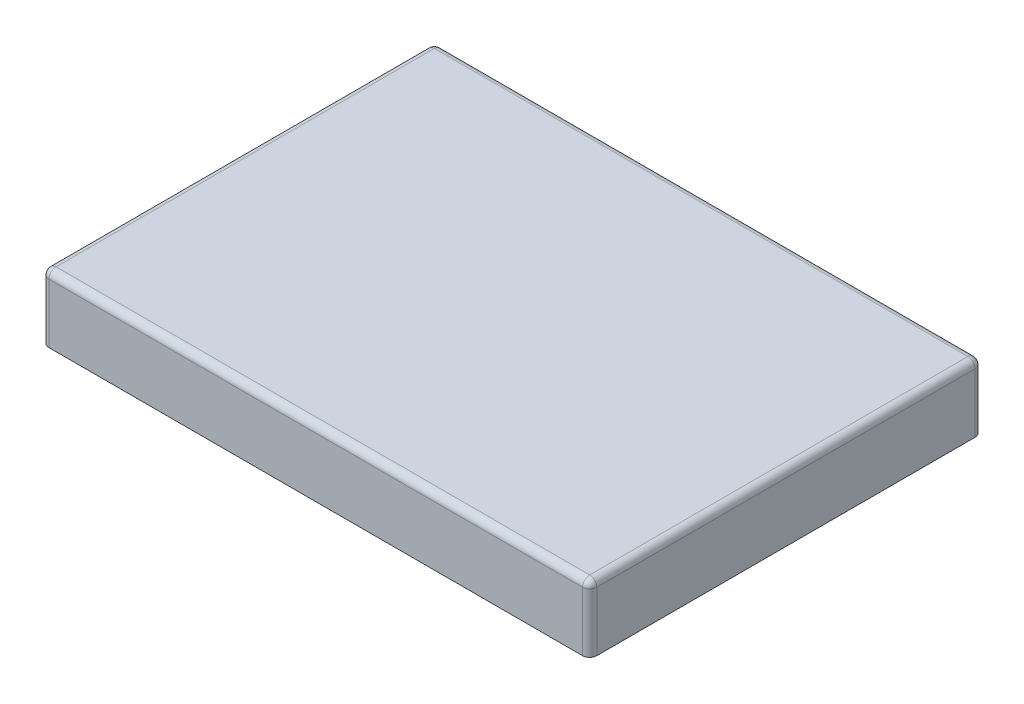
ISO-10303-21;
HEADER;
FILE_DESCRIPTION(('STEP AP214'),'2;1');
FILE_NAME('part.step','',(''),(''),'','','');
FILE_SCHEMA(('AUTOMOTIVE_DESIGN { 1 0 10303 214 1 1 1 1 }'));
ENDSEC;
DATA;
#1=APPLICATION_CONTEXT('core data for automotive mechanical design processes');
#2=APPLICATION_PROTOCOL_DEFINITION('international standard','automotive_design',2000,#1);
#3=PRODUCT_CONTEXT('',#1,'mechanical');
#4=PRODUCT('Part','Part','',(#3));
#5=PRODUCT_RELATED_PRODUCT_CATEGORY('part','',(#4));
#6=PRODUCT_DEFINITION_FORMATION('','',#4);
#7=PRODUCT_DEFINITION_CONTEXT('part definition',#1,'design');
#8=PRODUCT_DEFINITION('design','',#6,#7);
#9=PRODUCT_DEFINITION_SHAPE('','',#8);
#10=(LENGTH_UNIT() NAMED_UNIT(*) SI_UNIT(.MILLI.,.METRE.));
#11=(NAMED_UNIT(*) PLANE_ANGLE_UNIT() SI_UNIT($,.RADIAN.));
#12=(NAMED_UNIT(*) SI_UNIT($,.STERADIAN.) SOLID_ANGLE_UNIT());
#13=UNCERTAINTY_MEASURE_WITH_UNIT(LENGTH_MEASURE(1.E-05),#10,'distance_accuracy_value','');
#14=(GEOMETRIC_REPRESENTATION_CONTEXT(3) GLOBAL_UNCERTAINTY_ASSIGNED_CONTEXT((#13)) GLOBAL_UNIT_ASSIGNED_CONTEXT((#10,
#11,#12)) REPRESENTATION_CONTEXT('',''));
#15=CARTESIAN_POINT('',(0.,0.,0.));
#16=DIRECTION('',(0.,0.,1.));
#17=DIRECTION('',(1.,0.,0.));
#18=AXIS2_PLACEMENT_3D('',#15,#16,#17);
#19=CARTESIAN_POINT('',(0.,102.,0.));
#20=DIRECTION('',(0.,1.,0.));
#21=DIRECTION('',(0.,0.,1.));
#22=AXIS2_PLACEMENT_3D('',#19,#20,#21);
#23=PLANE('',#22);
#24=CARTESIAN_POINT('',(225.,102.,159.5));
#25=DIRECTION('',(0.,1.,0.));
#26=DIRECTION('',(0.,0.,1.));
#27=AXIS2_PLACEMENT_3D('',#24,#25,#26);
#28=CIRCLE('',#27,6.);
#29=CARTESIAN_POINT('',(231.,102.,159.5));
#30=VERTEX_POINT('',#29);
#31=CARTESIAN_POINT('',(225.,102.,165.5));
#32=VERTEX_POINT('',#31);
#33=EDGE_CURVE('E38',#30,#32,#28,.F.);
#34=ORIENTED_EDGE('',*,*,#33,.T.);
#35=DIRECTION('',(1.,0.,0.));
#36=VECTOR('',#35,1.);
#37=CARTESIAN_POINT('',(-231.,102.,165.5));
#38=LINE('',#37,#36);
#39=CARTESIAN_POINT('',(-225.,102.,165.5));
#40=VERTEX_POINT('',#39);
#41=EDGE_CURVE('E247',#40,#32,#38,.T.);
#42=ORIENTED_EDGE('',*,*,#41,.F.);
#43=CARTESIAN_POINT('',(-225.,102.,159.5));
#44=DIRECTION('',(0.,1.,0.));
#45=DIRECTION('',(0.,0.,1.));
#46=AXIS2_PLACEMENT_3D('',#43,#44,#45);
#47=CIRCLE('',#46,6.);
#48=CARTESIAN_POINT('',(-231.,102.,159.5));
#49=VERTEX_POINT('',#48);
#50=EDGE_CURVE('E250',#40,#49,#47,.F.);
#51=ORIENTED_EDGE('',*,*,#50,.T.);
#52=DIRECTION('',(0.,0.,1.));
#53=VECTOR('',#52,1.);
#54=CARTESIAN_POINT('',(-231.,102.,165.5));
#55=LINE('',#54,#53);
#56=CARTESIAN_POINT('',(-231.,102.,-159.5));
#57=VERTEX_POINT('',#56);
#58=EDGE_CURVE('E245',#57,#49,#55,.T.);
#59=ORIENTED_EDGE('',*,*,#58,.F.);
#60=CARTESIAN_POINT('',(-225.,102.,-159.5));
#61=DIRECTION('',(0.,1.,0.));
#62=DIRECTION('',(0.,0.,1.));
#63=AXIS2_PLACEMENT_3D('',#60,#61,#62);
#64=CIRCLE('',#63,6.);
#65=CARTESIAN_POINT('',(-225.,102.,-165.5));
#66=VERTEX_POINT('',#65);
#67=EDGE_CURVE('E239',#57,#66,#64,.F.);
#68=ORIENTED_EDGE('',*,*,#67,.T.);
#69=DIRECTION('',(-1.,0.,0.));
#70=VECTOR('',#69,1.);
#71=CARTESIAN_POINT('',(-231.,102.,-165.5));
#72=LINE('',#71,#70);
#73=CARTESIAN_POINT('',(225.,102.,-165.5));
#74=VERTEX_POINT('',#73);
#75=EDGE_CURVE('E203',#74,#66,#72,.T.);
#76=ORIENTED_EDGE('',*,*,#75,.F.);
#77=CARTESIAN_POINT('',(225.,102.,-159.5));
#78=DIRECTION('',(0.,1.,0.));
#79=DIRECTION('',(0.,0.,1.));
#80=AXIS2_PLACEMENT_3D('',#77,#78,#79);
#81=CIRCLE('',#80,6.);
#82=CARTESIAN_POINT('',(231.,102.,-159.5));
#83=VERTEX_POINT('',#82);
#84=EDGE_CURVE('E242',#74,#83,#81,.F.);
#85=ORIENTED_EDGE('',*,*,#84,.T.);
#86=DIRECTION('',(0.,0.,-1.));
#87=VECTOR('',#86,1.);
#88=CARTESIAN_POINT('',(231.,102.,165.5));
#89=LINE('',#88,#87);
#90=EDGE_CURVE('E244',#30,#83,#89,.T.);
#91=ORIENTED_EDGE('',*,*,#90,.F.);
#92=EDGE_LOOP('',(#34,#42,#51,#59,#68,#76,#85,#91));
#93=FACE_BOUND('',#92,.T.);
#94=DIRECTION('',(0.,0.,-1.));
#95=VECTOR('',#94,1.);
#96=CARTESIAN_POINT('',(221.,102.,-155.5));
#97=LINE('',#96,#95);
#98=CARTESIAN_POINT('',(221.,102.,155.5));
#99=VERTEX_POINT('',#98);
#100=CARTESIAN_POINT('',(221.,102.,-155.5));
#101=VERTEX_POINT('',#100);
#102=EDGE_CURVE('E237',#99,#101,#97,.T.);
#103=ORIENTED_EDGE('',*,*,#102,.T.);
#104=DIRECTION('',(-1.,0.,0.));
#105=VECTOR('',#104,1.);
#106=CARTESIAN_POINT('',(221.,102.,-155.5));
#107=LINE('',#106,#105);
#108=CARTESIAN_POINT('',(-221.,102.,-155.5));
#109=VERTEX_POINT('',#108);
#110=EDGE_CURVE('E155',#101,#109,#107,.T.);
#111=ORIENTED_EDGE('',*,*,#110,.T.);
#112=DIRECTION('',(0.,0.,1.));
#113=VECTOR('',#112,1.);
#114=CARTESIAN_POINT('',(-221.,102.,-155.5));
#115=LINE('',#114,#113);
#116=CARTESIAN_POINT('',(-221.,102.,155.5));
#117=VERTEX_POINT('',#116);
#118=EDGE_CURVE('E43',#109,#117,#115,.T.);
#119=ORIENTED_EDGE('',*,*,#118,.T.);
#120=DIRECTION('',(1.,0.,0.));
#121=VECTOR('',#120,1.);
#122=CARTESIAN_POINT('',(221.,102.,155.5));
#123=LINE('',#122,#121);
#124=EDGE_CURVE('E11',#117,#99,#123,.T.);
#125=ORIENTED_EDGE('',*,*,#124,.T.);
#126=EDGE_LOOP('',(#103,#111,#119,#125));
#127=FACE_BOUND('',#126,.T.);
#128=ADVANCED_FACE('F35',(#93,#127),#23,.F.);
#129=CARTESIAN_POINT('',(221.,147.,-155.5));
#130=DIRECTION('',(-1.,0.,0.));
#131=DIRECTION('',(0.,0.,1.));
#132=AXIS2_PLACEMENT_3D('',#129,#130,#131);
#133=PLANE('',#132);
#134=ORIENTED_EDGE('',*,*,#102,.F.);
#135=DIRECTION('',(0.,-1.,0.));
#136=VECTOR('',#135,1.);
#137=CARTESIAN_POINT('',(221.,147.,155.5));
#138=LINE('',#137,#136);
#139=CARTESIAN_POINT('',(221.,147.,155.5));
#140=VERTEX_POINT('',#139);
#141=EDGE_CURVE('E151',#140,#99,#138,.T.);
#142=ORIENTED_EDGE('',*,*,#141,.F.);
#143=DIRECTION('',(0.,0.,-1.));
#144=VECTOR('',#143,1.);
#145=CARTESIAN_POINT('',(221.,147.,-155.5));
#146=LINE('',#145,#144);
#147=CARTESIAN_POINT('',(221.,147.,-155.5));
#148=VERTEX_POINT('',#147);
#149=EDGE_CURVE('E139',#140,#148,#146,.T.);
#150=ORIENTED_EDGE('',*,*,#149,.T.);
#151=DIRECTION('',(0.,-1.,0.));
#152=VECTOR('',#151,1.);
#153=CARTESIAN_POINT('',(221.,147.,-155.5));
#154=LINE('',#153,#152);
#155=EDGE_CURVE('E150',#148,#101,#154,.T.);
#156=ORIENTED_EDGE('',*,*,#155,.T.);
#157=EDGE_LOOP('',(#134,#142,#150,#156));
#158=FACE_BOUND('',#157,.T.);
#159=ADVANCED_FACE('F149',(#158),#133,.T.);
#160=CARTESIAN_POINT('',(221.,147.,-155.5));
#161=DIRECTION('',(0.,0.,1.));
#162=DIRECTION('',(1.,0.,0.));
#163=AXIS2_PLACEMENT_3D('',#160,#161,#162);
#164=PLANE('',#163);
#165=ORIENTED_EDGE('',*,*,#110,.F.);
#166=ORIENTED_EDGE('',*,*,#155,.F.);
#167=DIRECTION('',(-1.,0.,0.));
#168=VECTOR('',#167,1.);
#169=CARTESIAN_POINT('',(221.,147.,-155.5));
#170=LINE('',#169,#168);
#171=CARTESIAN_POINT('',(-221.,147.,-155.5));
#172=VERTEX_POINT('',#171);
#173=EDGE_CURVE('E135',#148,#172,#170,.T.);
#174=ORIENTED_EDGE('',*,*,#173,.T.);
#175=DIRECTION('',(0.,-1.,0.));
#176=VECTOR('',#175,1.);
#177=CARTESIAN_POINT('',(-221.,147.,-155.5));
#178=LINE('',#177,#176);
#179=EDGE_CURVE('E157',#172,#109,#178,.T.);
#180=ORIENTED_EDGE('',*,*,#179,.T.);
#181=EDGE_LOOP('',(#165,#166,#174,#180));
#182=FACE_BOUND('',#181,.T.);
#183=ADVANCED_FACE('F153',(#182),#164,.T.);
#184=CARTESIAN_POINT('',(-221.,147.,-155.5));
#185=DIRECTION('',(1.,0.,0.));
#186=DIRECTION('',(0.,0.,-1.));
#187=AXIS2_PLACEMENT_3D('',#184,#185,#186);
#188=PLANE('',#187);
#189=ORIENTED_EDGE('',*,*,#118,.F.);
#190=ORIENTED_EDGE('',*,*,#179,.F.);
#191=DIRECTION('',(0.,0.,1.));
#192=VECTOR('',#191,1.);
#193=CARTESIAN_POINT('',(-221.,147.,-155.5));
#194=LINE('',#193,#192);
#195=CARTESIAN_POINT('',(-221.,147.,155.5));
#196=VERTEX_POINT('',#195);
#197=EDGE_CURVE('E140',#172,#196,#194,.T.);
#198=ORIENTED_EDGE('',*,*,#197,.T.);
#199=DIRECTION('',(0.,-1.,0.));
#200=VECTOR('',#199,1.);
#201=CARTESIAN_POINT('',(-221.,147.,155.5));
#202=LINE('',#201,#200);
#203=EDGE_CURVE('E162',#196,#117,#202,.T.);
#204=ORIENTED_EDGE('',*,*,#203,.T.);
#205=EDGE_LOOP('',(#189,#190,#198,#204));
#206=FACE_BOUND('',#205,.T.);
#207=ADVANCED_FACE('F369',(#206),#188,.T.);
#208=CARTESIAN_POINT('',(221.,147.,155.5));
#209=DIRECTION('',(0.,0.,-1.));
#210=DIRECTION('',(-1.,0.,0.));
#211=AXIS2_PLACEMENT_3D('',#208,#209,#210);
#212=PLANE('',#211);
#213=ORIENTED_EDGE('',*,*,#124,.F.);
#214=ORIENTED_EDGE('',*,*,#203,.F.);
#215=DIRECTION('',(1.,0.,0.));
#216=VECTOR('',#215,1.);
#217=CARTESIAN_POINT('',(221.,147.,155.5));
#218=LINE('',#217,#216);
#219=EDGE_CURVE('E507',#196,#140,#218,.T.);
#220=ORIENTED_EDGE('',*,*,#219,.T.);
#221=ORIENTED_EDGE('',*,*,#141,.T.);
#222=EDGE_LOOP('',(#213,#214,#220,#221));
#223=FACE_BOUND('',#222,.T.);
#224=ADVANCED_FACE('F372',(#223),#212,.T.);
#225=CARTESIAN_POINT('',(0.,147.,0.));
#226=DIRECTION('',(0.,-1.,0.));
#227=DIRECTION('',(0.,0.,-1.));
#228=AXIS2_PLACEMENT_3D('',#225,#226,#227);
#229=PLANE('',#228);
#230=ORIENTED_EDGE('',*,*,#149,.F.);
#231=ORIENTED_EDGE('',*,*,#219,.F.);
#232=ORIENTED_EDGE('',*,*,#197,.F.);
#233=ORIENTED_EDGE('',*,*,#173,.F.);
#234=EDGE_LOOP('',(#230,#231,#232,#233));
#235=FACE_BOUND('',#234,.T.);
#236=ADVANCED_FACE('F137',(#235),#229,.T.);
#237=CARTESIAN_POINT('',(-231.,158.,165.5));
#238=DIRECTION('',(1.,0.,0.));
#239=DIRECTION('',(0.,0.,-1.));
#240=AXIS2_PLACEMENT_3D('',#237,#238,#239);
#241=PLANE('',#240);
#242=DIRECTION('',(0.,-1.,0.));
#243=VECTOR('',#242,1.);
#244=CARTESIAN_POINT('',(-231.,158.,-159.5));
#245=LINE('',#244,#243);
#246=CARTESIAN_POINT('',(-231.,152.,-159.5));
#247=VERTEX_POINT('',#246);
#248=EDGE_CURVE('E178',#247,#57,#245,.T.);
#249=ORIENTED_EDGE('',*,*,#248,.T.);
#250=ORIENTED_EDGE('',*,*,#58,.T.);
#251=DIRECTION('',(0.,-1.,0.));
#252=VECTOR('',#251,1.);
#253=CARTESIAN_POINT('',(-231.,158.,159.5));
#254=LINE('',#253,#252);
#255=CARTESIAN_POINT('',(-231.,152.,159.5));
#256=VERTEX_POINT('',#255);
#257=EDGE_CURVE('E176',#49,#256,#254,.F.);
#258=ORIENTED_EDGE('',*,*,#257,.T.);
#259=DIRECTION('',(0.,0.,1.));
#260=VECTOR('',#259,1.);
#261=CARTESIAN_POINT('',(-231.,152.,165.5));
#262=LINE('',#261,#260);
#263=EDGE_CURVE('E174',#256,#247,#262,.F.);
#264=ORIENTED_EDGE('',*,*,#263,.T.);
#265=EDGE_LOOP('',(#249,#250,#258,#264));
#266=FACE_BOUND('',#265,.T.);
#267=ADVANCED_FACE('F288',(#266),#241,.F.);
#268=CARTESIAN_POINT('',(-231.,158.,165.5));
#269=DIRECTION('',(0.,0.,-1.));
#270=DIRECTION('',(-1.,0.,0.));
#271=AXIS2_PLACEMENT_3D('',#268,#269,#270);
#272=PLANE('',#271);
#273=DIRECTION('',(0.,-1.,0.));
#274=VECTOR('',#273,1.);
#275=CARTESIAN_POINT('',(-225.,158.,165.5));
#276=LINE('',#275,#274);
#277=CARTESIAN_POINT('',(-225.,152.,165.5));
#278=VERTEX_POINT('',#277);
#279=EDGE_CURVE('E185',#278,#40,#276,.T.);
#280=ORIENTED_EDGE('',*,*,#279,.T.);
#281=ORIENTED_EDGE('',*,*,#41,.T.);
#282=DIRECTION('',(0.,-1.,0.));
#283=VECTOR('',#282,1.);
#284=CARTESIAN_POINT('',(225.,158.,165.5));
#285=LINE('',#284,#283);
#286=CARTESIAN_POINT('',(225.,152.,165.5));
#287=VERTEX_POINT('',#286);
#288=EDGE_CURVE('E183',#32,#287,#285,.F.);
#289=ORIENTED_EDGE('',*,*,#288,.T.);
#290=DIRECTION('',(1.,0.,0.));
#291=VECTOR('',#290,1.);
#292=CARTESIAN_POINT('',(-231.,152.,165.5));
#293=LINE('',#292,#291);
#294=EDGE_CURVE('E181',#287,#278,#293,.F.);
#295=ORIENTED_EDGE('',*,*,#294,.T.);
#296=EDGE_LOOP('',(#280,#281,#289,#295));
#297=FACE_BOUND('',#296,.T.);
#298=ADVANCED_FACE('F256',(#297),#272,.F.);
#299=CARTESIAN_POINT('',(231.,158.,165.5));
#300=DIRECTION('',(-1.,0.,0.));
#301=DIRECTION('',(0.,0.,1.));
#302=AXIS2_PLACEMENT_3D('',#299,#300,#301);
#303=PLANE('',#302);
#304=DIRECTION('',(0.,-1.,0.));
#305=VECTOR('',#304,1.);
#306=CARTESIAN_POINT('',(231.,158.,159.5));
#307=LINE('',#306,#305);
#308=CARTESIAN_POINT('',(231.,152.,159.5));
#309=VERTEX_POINT('',#308);
#310=EDGE_CURVE('E192',#309,#30,#307,.T.);
#311=ORIENTED_EDGE('',*,*,#310,.T.);
#312=ORIENTED_EDGE('',*,*,#90,.T.);
#313=DIRECTION('',(0.,-1.,0.));
#314=VECTOR('',#313,1.);
#315=CARTESIAN_POINT('',(231.,158.,-159.5));
#316=LINE('',#315,#314);
#317=CARTESIAN_POINT('',(231.,152.,-159.5));
#318=VERTEX_POINT('',#317);
#319=EDGE_CURVE('E190',#83,#318,#316,.F.);
#320=ORIENTED_EDGE('',*,*,#319,.T.);
#321=DIRECTION('',(0.,0.,-1.));
#322=VECTOR('',#321,1.);
#323=CARTESIAN_POINT('',(231.,152.,165.5));
#324=LINE('',#323,#322);
#325=EDGE_CURVE('E188',#318,#309,#324,.F.);
#326=ORIENTED_EDGE('',*,*,#325,.T.);
#327=EDGE_LOOP('',(#311,#312,#320,#326));
#328=FACE_BOUND('',#327,.T.);
#329=ADVANCED_FACE('F320',(#328),#303,.F.);
#330=CARTESIAN_POINT('',(-231.,158.,-165.5));
#331=DIRECTION('',(0.,0.,1.));
#332=DIRECTION('',(1.,0.,0.));
#333=AXIS2_PLACEMENT_3D('',#330,#331,#332);
#334=PLANE('',#333);
#335=DIRECTION('',(0.,-1.,0.));
#336=VECTOR('',#335,1.);
#337=CARTESIAN_POINT('',(225.,158.,-165.5));
#338=LINE('',#337,#336);
#339=CARTESIAN_POINT('',(225.,152.,-165.5));
#340=VERTEX_POINT('',#339);
#341=EDGE_CURVE('E168',#340,#74,#338,.T.);
#342=ORIENTED_EDGE('',*,*,#341,.T.);
#343=ORIENTED_EDGE('',*,*,#75,.T.);
#344=DIRECTION('',(0.,-1.,0.));
#345=VECTOR('',#344,1.);
#346=CARTESIAN_POINT('',(-225.,158.,-165.5));
#347=LINE('',#346,#345);
#348=CARTESIAN_POINT('',(-225.,152.,-165.5));
#349=VERTEX_POINT('',#348);
#350=EDGE_CURVE('E172',#66,#349,#347,.F.);
#351=ORIENTED_EDGE('',*,*,#350,.T.);
#352=DIRECTION('',(-1.,0.,0.));
#353=VECTOR('',#352,1.);
#354=CARTESIAN_POINT('',(-231.,152.,-165.5));
#355=LINE('',#354,#353);
#356=EDGE_CURVE('E166',#349,#340,#355,.F.);
#357=ORIENTED_EDGE('',*,*,#356,.T.);
#358=EDGE_LOOP('',(#342,#343,#351,#357));
#359=FACE_BOUND('',#358,.T.);
#360=ADVANCED_FACE('F295',(#359),#334,.F.);
#361=CARTESIAN_POINT('',(0.,158.,0.));
#362=DIRECTION('',(0.,-1.,0.));
#363=DIRECTION('',(0.,0.,-1.));
#364=AXIS2_PLACEMENT_3D('',#361,#362,#363);
#365=PLANE('',#364);
#366=DIRECTION('',(0.,0.,-1.));
#367=VECTOR('',#366,1.);
#368=CARTESIAN_POINT('',(225.,158.,0.));
#369=LINE('',#368,#367);
#370=CARTESIAN_POINT('',(225.,158.,159.5));
#371=VERTEX_POINT('',#370);
#372=CARTESIAN_POINT('',(225.,158.,-159.5));
#373=VERTEX_POINT('',#372);
#374=EDGE_CURVE('E199',#371,#373,#369,.T.);
#375=ORIENTED_EDGE('',*,*,#374,.T.);
#376=DIRECTION('',(-1.,0.,0.));
#377=VECTOR('',#376,1.);
#378=CARTESIAN_POINT('',(0.,158.,-159.5));
#379=LINE('',#378,#377);
#380=CARTESIAN_POINT('',(-225.,158.,-159.5));
#381=VERTEX_POINT('',#380);
#382=EDGE_CURVE('E201',#373,#381,#379,.T.);
#383=ORIENTED_EDGE('',*,*,#382,.T.);
#384=DIRECTION('',(0.,0.,1.));
#385=VECTOR('',#384,1.);
#386=CARTESIAN_POINT('',(-225.,158.,0.));
#387=LINE('',#386,#385);
#388=CARTESIAN_POINT('',(-225.,158.,159.5));
#389=VERTEX_POINT('',#388);
#390=EDGE_CURVE('E195',#381,#389,#387,.T.);
#391=ORIENTED_EDGE('',*,*,#390,.T.);
#392=DIRECTION('',(1.,0.,0.));
#393=VECTOR('',#392,1.);
#394=CARTESIAN_POINT('',(0.,158.,159.5));
#395=LINE('',#394,#393);
#396=EDGE_CURVE('E197',#389,#371,#395,.T.);
#397=ORIENTED_EDGE('',*,*,#396,.T.);
#398=EDGE_LOOP('',(#375,#383,#391,#397));
#399=FACE_BOUND('',#398,.T.);
#400=ADVANCED_FACE('F308',(#399),#365,.F.);
#401=CARTESIAN_POINT('',(0.,152.,159.5));
#402=DIRECTION('',(1.,0.,0.));
#403=DIRECTION('',(0.,0.,-1.));
#404=AXIS2_PLACEMENT_3D('',#401,#402,#403);
#405=CYLINDRICAL_SURFACE('',#404,6.);
#406=CARTESIAN_POINT('',(225.,152.,159.5));
#407=DIRECTION('',(1.,0.,0.));
#408=DIRECTION('',(0.,0.,-1.));
#409=AXIS2_PLACEMENT_3D('',#406,#407,#408);
#410=CIRCLE('',#409,6.);
#411=EDGE_CURVE('E169',#371,#287,#410,.T.);
#412=ORIENTED_EDGE('',*,*,#411,.F.);
#413=ORIENTED_EDGE('',*,*,#396,.F.);
#414=CARTESIAN_POINT('',(-225.,152.,159.5));
#415=DIRECTION('',(-1.,0.,0.));
#416=DIRECTION('',(0.,0.,1.));
#417=AXIS2_PLACEMENT_3D('',#414,#415,#416);
#418=CIRCLE('',#417,6.);
#419=EDGE_CURVE('E230',#278,#389,#418,.T.);
#420=ORIENTED_EDGE('',*,*,#419,.F.);
#421=ORIENTED_EDGE('',*,*,#294,.F.);
#422=EDGE_LOOP('',(#412,#413,#420,#421));
#423=FACE_BOUND('',#422,.T.);
#424=ADVANCED_FACE('F273',(#423),#405,.T.);
#425=CARTESIAN_POINT('',(225.,152.,159.5));
#426=DIRECTION('',(0.,0.,1.));
#427=DIRECTION('',(1.,0.,0.));
#428=AXIS2_PLACEMENT_3D('',#425,#426,#427);
#429=SPHERICAL_SURFACE('',#428,6.);
#430=CARTESIAN_POINT('',(225.,152.,159.5));
#431=DIRECTION('',(0.,0.,1.));
#432=DIRECTION('',(1.,0.,0.));
#433=AXIS2_PLACEMENT_3D('',#430,#431,#432);
#434=CIRCLE('',#433,6.);
#435=EDGE_CURVE('E224',#371,#309,#434,.F.);
#436=ORIENTED_EDGE('',*,*,#435,.F.);
#437=ORIENTED_EDGE('',*,*,#411,.T.);
#438=CARTESIAN_POINT('',(225.,152.,159.5));
#439=DIRECTION('',(0.,1.,0.));
#440=DIRECTION('',(0.,0.,1.));
#441=AXIS2_PLACEMENT_3D('',#438,#439,#440);
#442=CIRCLE('',#441,6.);
#443=EDGE_CURVE('E227',#309,#287,#442,.F.);
#444=ORIENTED_EDGE('',*,*,#443,.F.);
#445=EDGE_LOOP('',(#436,#437,#444));
#446=FACE_BOUND('',#445,.T.);
#447=ADVANCED_FACE('F268',(#446),#429,.T.);
#448=CARTESIAN_POINT('',(-225.,152.,159.5));
#449=DIRECTION('',(0.,1.,0.));
#450=DIRECTION('',(0.,0.,1.));
#451=AXIS2_PLACEMENT_3D('',#448,#449,#450);
#452=SPHERICAL_SURFACE('',#451,6.);
#453=CARTESIAN_POINT('',(-225.,152.,159.5));
#454=DIRECTION('',(0.,1.,0.));
#455=DIRECTION('',(0.,0.,1.));
#456=AXIS2_PLACEMENT_3D('',#453,#454,#455);
#457=CIRCLE('',#456,6.);
#458=EDGE_CURVE('E218',#278,#256,#457,.F.);
#459=ORIENTED_EDGE('',*,*,#458,.F.);
#460=ORIENTED_EDGE('',*,*,#419,.T.);
#461=CARTESIAN_POINT('',(-225.,152.,159.5));
#462=DIRECTION('',(0.,0.,1.));
#463=DIRECTION('',(1.,0.,0.));
#464=AXIS2_PLACEMENT_3D('',#461,#462,#463);
#465=CIRCLE('',#464,6.);
#466=EDGE_CURVE('E221',#256,#389,#465,.F.);
#467=ORIENTED_EDGE('',*,*,#466,.F.);
#468=EDGE_LOOP('',(#459,#460,#467));
#469=FACE_BOUND('',#468,.T.);
#470=ADVANCED_FACE('F278',(#469),#452,.T.);
#471=CARTESIAN_POINT('',(225.,158.,159.5));
#472=DIRECTION('',(0.,-1.,0.));
#473=DIRECTION('',(0.,0.,-1.));
#474=AXIS2_PLACEMENT_3D('',#471,#472,#473);
#475=CYLINDRICAL_SURFACE('',#474,6.);
#476=ORIENTED_EDGE('',*,*,#33,.F.);
#477=ORIENTED_EDGE('',*,*,#310,.F.);
#478=ORIENTED_EDGE('',*,*,#443,.T.);
#479=ORIENTED_EDGE('',*,*,#288,.F.);
#480=EDGE_LOOP('',(#476,#477,#478,#479));
#481=FACE_BOUND('',#480,.T.);
#482=ADVANCED_FACE('F264',(#481),#475,.T.);
#483=CARTESIAN_POINT('',(225.,152.,0.));
#484=DIRECTION('',(0.,0.,-1.));
#485=DIRECTION('',(-1.,0.,0.));
#486=AXIS2_PLACEMENT_3D('',#483,#484,#485);
#487=CYLINDRICAL_SURFACE('',#486,6.);
#488=ORIENTED_EDGE('',*,*,#435,.T.);
#489=ORIENTED_EDGE('',*,*,#325,.F.);
#490=CARTESIAN_POINT('',(225.,152.,-159.5));
#491=DIRECTION('',(0.,0.,-1.));
#492=DIRECTION('',(-1.,0.,0.));
#493=AXIS2_PLACEMENT_3D('',#490,#491,#492);
#494=CIRCLE('',#493,6.);
#495=EDGE_CURVE('E215',#373,#318,#494,.T.);
#496=ORIENTED_EDGE('',*,*,#495,.F.);
#497=ORIENTED_EDGE('',*,*,#374,.F.);
#498=EDGE_LOOP('',(#488,#489,#496,#497));
#499=FACE_BOUND('',#498,.T.);
#500=ADVANCED_FACE('F312',(#499),#487,.T.);
#501=CARTESIAN_POINT('',(0.,152.,-159.5));
#502=DIRECTION('',(-1.,0.,0.));
#503=DIRECTION('',(0.,0.,1.));
#504=AXIS2_PLACEMENT_3D('',#501,#502,#503);
#505=CYLINDRICAL_SURFACE('',#504,6.);
#506=CARTESIAN_POINT('',(-225.,152.,-159.5));
#507=DIRECTION('',(-1.,0.,0.));
#508=DIRECTION('',(0.,0.,1.));
#509=AXIS2_PLACEMENT_3D('',#506,#507,#508);
#510=CIRCLE('',#509,6.);
#511=EDGE_CURVE('E209',#381,#349,#510,.T.);
#512=ORIENTED_EDGE('',*,*,#511,.F.);
#513=ORIENTED_EDGE('',*,*,#382,.F.);
#514=CARTESIAN_POINT('',(225.,152.,-159.5));
#515=DIRECTION('',(1.,0.,0.));
#516=DIRECTION('',(0.,1.,0.));
#517=AXIS2_PLACEMENT_3D('',#514,#515,#516);
#518=CIRCLE('',#517,6.);
#519=EDGE_CURVE('E212',#340,#373,#518,.T.);
#520=ORIENTED_EDGE('',*,*,#519,.F.);
#521=ORIENTED_EDGE('',*,*,#356,.F.);
#522=EDGE_LOOP('',(#512,#513,#520,#521));
#523=FACE_BOUND('',#522,.T.);
#524=ADVANCED_FACE('F299',(#523),#505,.T.);
#525=CARTESIAN_POINT('',(-225.,152.,0.));
#526=DIRECTION('',(0.,0.,1.));
#527=DIRECTION('',(1.,0.,0.));
#528=AXIS2_PLACEMENT_3D('',#525,#526,#527);
#529=CYLINDRICAL_SURFACE('',#528,6.);
#530=ORIENTED_EDGE('',*,*,#466,.T.);
#531=ORIENTED_EDGE('',*,*,#390,.F.);
#532=CARTESIAN_POINT('',(-225.,152.,-159.5));
#533=DIRECTION('',(0.,0.,-1.));
#534=DIRECTION('',(-1.,0.,0.));
#535=AXIS2_PLACEMENT_3D('',#532,#533,#534);
#536=CIRCLE('',#535,6.);
#537=EDGE_CURVE('E207',#247,#381,#536,.T.);
#538=ORIENTED_EDGE('',*,*,#537,.F.);
#539=ORIENTED_EDGE('',*,*,#263,.F.);
#540=EDGE_LOOP('',(#530,#531,#538,#539));
#541=FACE_BOUND('',#540,.T.);
#542=ADVANCED_FACE('F306',(#541),#529,.T.);
#543=CARTESIAN_POINT('',(-225.,158.,159.5));
#544=DIRECTION('',(0.,-1.,0.));
#545=DIRECTION('',(0.,0.,-1.));
#546=AXIS2_PLACEMENT_3D('',#543,#544,#545);
#547=CYLINDRICAL_SURFACE('',#546,6.);
#548=ORIENTED_EDGE('',*,*,#50,.F.);
#549=ORIENTED_EDGE('',*,*,#279,.F.);
#550=ORIENTED_EDGE('',*,*,#458,.T.);
#551=ORIENTED_EDGE('',*,*,#257,.F.);
#552=EDGE_LOOP('',(#548,#549,#550,#551));
#553=FACE_BOUND('',#552,.T.);
#554=ADVANCED_FACE('F282',(#553),#547,.T.);
#555=CARTESIAN_POINT('',(225.,152.,-159.5));
#556=DIRECTION('',(0.,1.,0.));
#557=DIRECTION('',(0.,0.,1.));
#558=AXIS2_PLACEMENT_3D('',#555,#556,#557);
#559=SPHERICAL_SURFACE('',#558,6.);
#560=ORIENTED_EDGE('',*,*,#519,.T.);
#561=ORIENTED_EDGE('',*,*,#495,.T.);
#562=CARTESIAN_POINT('',(225.,152.,-159.5));
#563=DIRECTION('',(0.,1.,0.));
#564=DIRECTION('',(0.,0.,1.));
#565=AXIS2_PLACEMENT_3D('',#562,#563,#564);
#566=CIRCLE('',#565,6.);
#567=EDGE_CURVE('E160',#340,#318,#566,.F.);
#568=ORIENTED_EDGE('',*,*,#567,.F.);
#569=EDGE_LOOP('',(#560,#561,#568));
#570=FACE_BOUND('',#569,.T.);
#571=ADVANCED_FACE('F314',(#570),#559,.T.);
#572=CARTESIAN_POINT('',(-225.,152.,-159.5));
#573=DIRECTION('',(0.,1.,0.));
#574=DIRECTION('',(0.,0.,1.));
#575=AXIS2_PLACEMENT_3D('',#572,#573,#574);
#576=SPHERICAL_SURFACE('',#575,6.);
#577=ORIENTED_EDGE('',*,*,#537,.T.);
#578=ORIENTED_EDGE('',*,*,#511,.T.);
#579=CARTESIAN_POINT('',(-225.,152.,-159.5));
#580=DIRECTION('',(0.,1.,0.));
#581=DIRECTION('',(0.,0.,1.));
#582=AXIS2_PLACEMENT_3D('',#579,#580,#581);
#583=CIRCLE('',#582,6.);
#584=EDGE_CURVE('E156',#247,#349,#583,.F.);
#585=ORIENTED_EDGE('',*,*,#584,.F.);
#586=EDGE_LOOP('',(#577,#578,#585));
#587=FACE_BOUND('',#586,.T.);
#588=ADVANCED_FACE('F304',(#587),#576,.T.);
#589=CARTESIAN_POINT('',(225.,158.,-159.5));
#590=DIRECTION('',(0.,-1.,0.));
#591=DIRECTION('',(0.,0.,-1.));
#592=AXIS2_PLACEMENT_3D('',#589,#590,#591);
#593=CYLINDRICAL_SURFACE('',#592,6.);
#594=ORIENTED_EDGE('',*,*,#84,.F.);
#595=ORIENTED_EDGE('',*,*,#341,.F.);
#596=ORIENTED_EDGE('',*,*,#567,.T.);
#597=ORIENTED_EDGE('',*,*,#319,.F.);
#598=EDGE_LOOP('',(#594,#595,#596,#597));
#599=FACE_BOUND('',#598,.T.);
#600=ADVANCED_FACE('F318',(#599),#593,.T.);
#601=CARTESIAN_POINT('',(-225.,158.,-159.5));
#602=DIRECTION('',(0.,-1.,0.));
#603=DIRECTION('',(0.,0.,-1.));
#604=AXIS2_PLACEMENT_3D('',#601,#602,#603);
#605=CYLINDRICAL_SURFACE('',#604,6.);
#606=ORIENTED_EDGE('',*,*,#67,.F.);
#607=ORIENTED_EDGE('',*,*,#248,.F.);
#608=ORIENTED_EDGE('',*,*,#584,.T.);
#609=ORIENTED_EDGE('',*,*,#350,.F.);
#610=EDGE_LOOP('',(#606,#607,#608,#609));
#611=FACE_BOUND('',#610,.T.);
#612=ADVANCED_FACE('F291',(#611),#605,.T.);
#613=CLOSED_SHELL('',(#128,#159,#183,#207,#224,#236,#267,#298,#329,#360,#400,#424,#447,#470,
#482,#500,#524,#542,#554,#571,#588,#600,#612));
#614=MANIFOLD_SOLID_BREP('B2',#613);
#615=ADVANCED_BREP_SHAPE_REPRESENTATION('',(#18,#614),#14);
#616=SHAPE_DEFINITION_REPRESENTATION(#9,#615);
ENDSEC;
END-ISO-10303-21;
